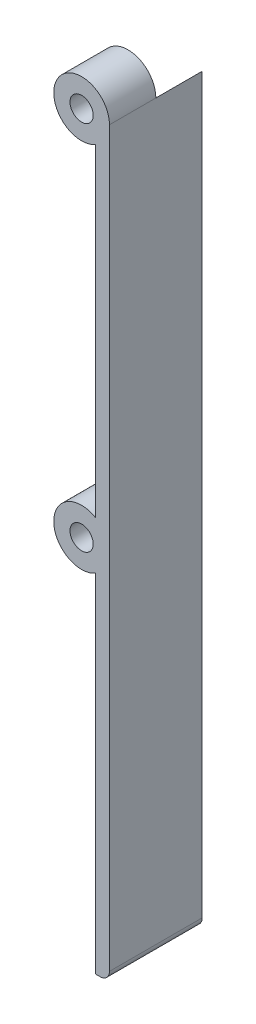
from build123d import *

# Parameters (mm, degrees)
ESQUISSE1_R             = 2.5
BOSS_EXTRU_1_DEPTH      = 20
ESQUISSE2_R             = 6
ENL_V_MAT_EXTRU_1_DEPTH = 10
CONG_1_R                = 2


with BuildPart() as part:
    # Esquisse1 → Boss.-Extru.1 (new body)
    with BuildSketch(Plane.XY):
        with BuildLine():
            Line((6, 80), (6, -80))
            Line((6, -80), (3, -80))
            Line((3, -80), (3, -5.196152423))
            ThreePointArc((3, -5.196152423), (-6, 0), (3, 5.196152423))
            Line((3, 5.196152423), (3, 74.803847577))
            ThreePointArc((3, 74.803847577), (-5.196152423, 83), (6, 80))
        make_face()
        Circle(ESQUISSE1_R, mode=Mode.SUBTRACT)
        with Locations((0, 80)):
            Circle(ESQUISSE1_R, mode=Mode.SUBTRACT)
    extrude(amount=BOSS_EXTRU_1_DEPTH)

    # Esquisse2 → Enl_v. mat.-Extru.1 (cut)
    with BuildSketch(Plane(origin=(0, 0, 0), x_dir=(-1, 0, 0), z_dir=(0, 0, -1))):
        with Locations((0, 80)):
            Circle(ESQUISSE2_R)
    extrude(amount=-ENL_V_MAT_EXTRU_1_DEPTH, mode=Mode.SUBTRACT)

    # Cong_1
    cong_1_edges = [part.edges().sort_by_distance(p)[0] for p in [
        (6, -80, 10),
    ]]
    fillet(cong_1_edges, radius=CONG_1_R)


solid = part.part
